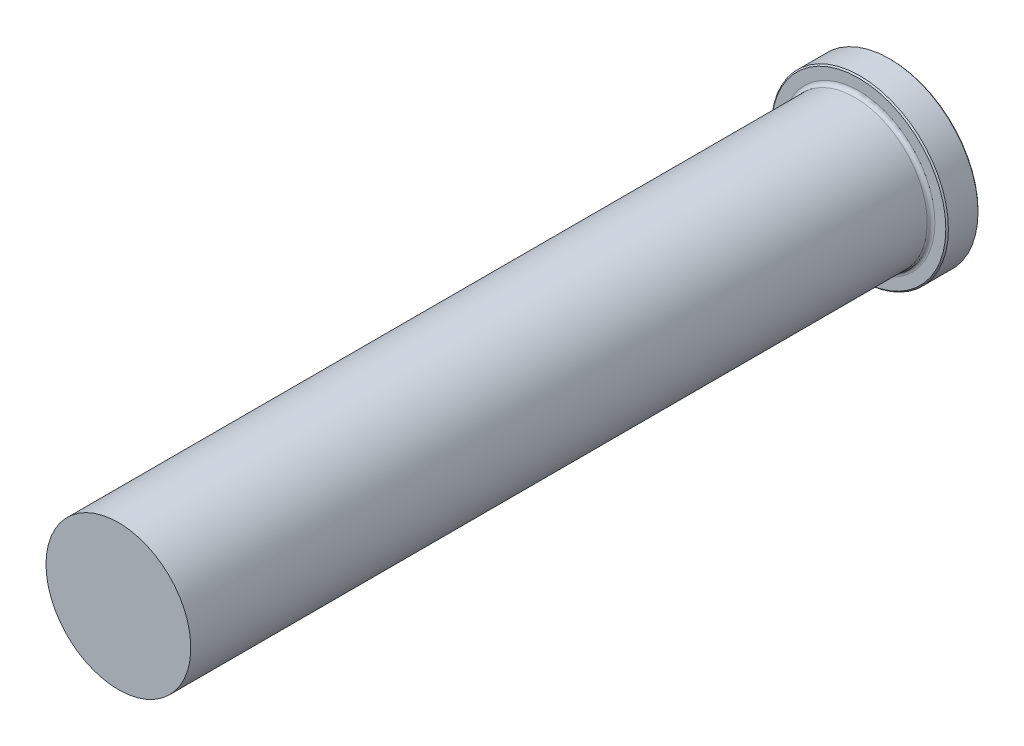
from build123d import *

# Parameters (mm, degrees)
FILLET1_R     = 0.762
CHAMFER1_SIZE = 0.254


with BuildPart() as part:
    # Sketch1 → Revolve1 (revolve)
    with BuildSketch(Plane(origin=(0, 0, 0), x_dir=(0, 0, -1), z_dir=(1, 0, 0)), mode=Mode.PRIVATE) as revolve1_sk:
        Polygon((0, 0), (0, 17.4625), (-6.35, 17.4625), (-6.35, 14.2875), (-152.4, 14.2875), (-152.4, 0), align=None)
    revolve(revolve1_sk.sketch.rotate(Axis((0, 0, 0), (0, 0, 1)), 90), axis=Axis((0, 0, 0), (0, 0, 1)))

    # Fillet1
    fillet1_edges = [part.edges().sort_by_distance(p)[0] for p in [
        (14.2875, 0, 6.35),
    ]]
    fillet(fillet1_edges, radius=FILLET1_R)

    # Chamfer1
    chamfer1_edges = [part.edges().sort_by_distance(p)[0] for p in [
        (17.4625, 0, 6.35),
        (17.4625, 0, 0),
    ]]
    chamfer(chamfer1_edges, length=CHAMFER1_SIZE)


solid = part.part
